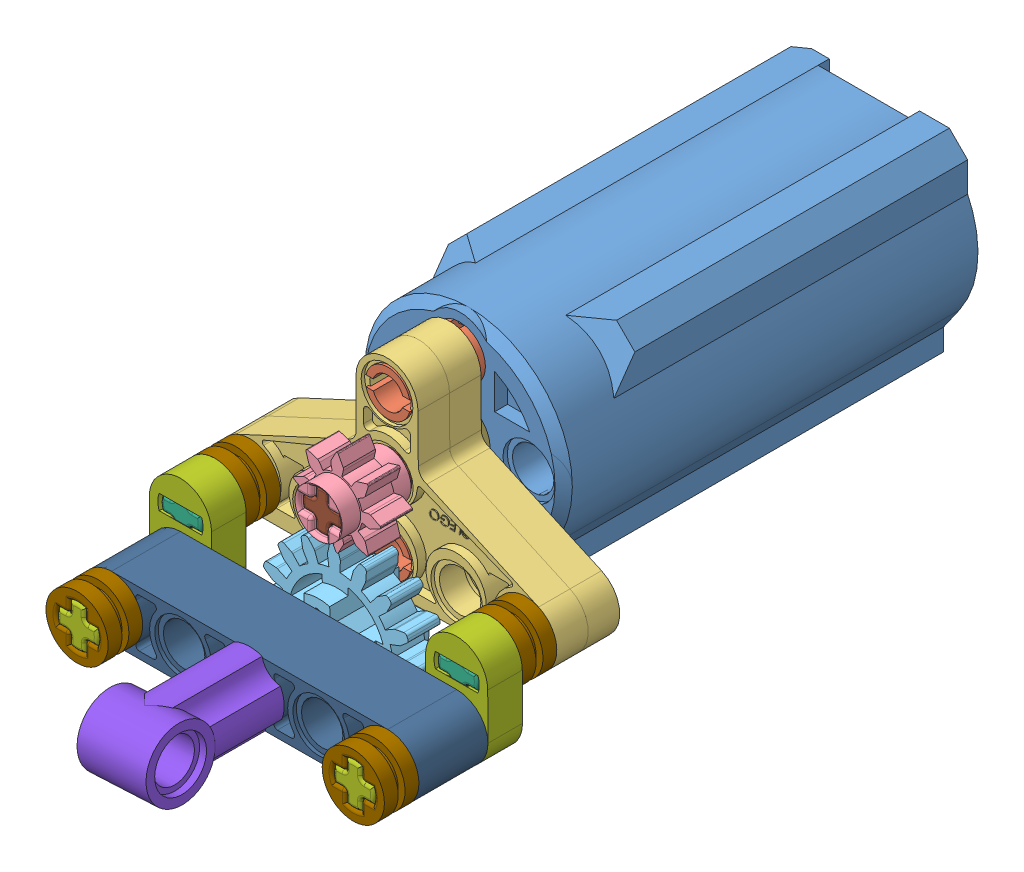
SolidWorks assembly 34.SLDASM, configuration 기본 (file format 9000). Lengths in mm.
Overall size (39.32 34.78 88.4).
20 component instances, 12 part files, 53 mates.
Components (placement in the parent):
- 9V Motor M-1: 9V Motor M.SLDPRT [기본] at (-7.0258 1.7944 48.1336) size (24 24 48.27)
- 2780 Pin with Friction Ridges Lengthwise WITH Center Slots-1: 2780 Pin with Friction Ridges Lengthwise WITH Center Slots.SLDPRT [기본] at (-7.0258 -6.2056 72.4336) x (1 0 0) z (0 1 0) size (6 16 5.88)
- 2905 Liftarm Triangle Thin-1: 2905 Liftarm Triangle Thin.SLDPRT [기본] at (-7.0101 -9.8056 75.0586) x (0.99999 0.004375 0) z (0.004375 -0.99999 0) size (39.2 3.65 23.2)
- 2905 Liftarm Triangle Thin-2: 2905 Liftarm Triangle Thin.SLDPRT [기본] at (-7.0101 -9.8055 78.7086) x (0.99999 0.004375 0) z (0.004375 -0.99999 0) size (39.2 3.65 23.2)
- 3647 Gear 8-1: 3647 Gear 8.SLDPRT [기본] at (-7.0258 1.7944 84.5336) x (1 0 0) z (0 1 0) size (10.06 8 10.06)
- 94925 Gear 16 old-1: 94925 Gear 16 old.SLDPRT [기본] at (-7.0025 -11.5384 84.5336) x (0.99871 0.05078 0) z (-0.05078 0.99871 0) size (18 8 18)
- 32062 Axle 2 Notched-1: 32062 Axle 2 Notched.SLDPRT [기본] at (-23.0257 -6.2755 72.4836) x (0.99999 0.004375 0) z (0.004375 -0.99999 0) size (4.8 16.01 4.8)
- 2853 Engine Crankshaft-1: 2853 Engine Crankshaft.SLDPRT [기본] at (-35.5332 -12.1174 85.2384) x (0.004375 -0.99999 0) z (0.99999 0.004375 0) size (12.53 16 7.2)
- 32013 Axle pin connector angled #1-1: 32013 Axle pin connector angled #1.SLDPRT [기본] at (-7.0025 -11.5384 96.5336) x (0 0 -1) z (0.99871 0.05078 0) size (16 8 8)
- 32123 Bush 0.5 Smooth-1: 32123 Bush 0.5 Smooth.SLDPRT [기본] at (10.5595 1.0715 83.3402) x (0.99999 0.004375 0) z (0.004375 -0.99999 0) size (7.2 4 7.2)
- 32316 Beam 5-1: 32316 Beam 5.SLDPRT [기본] at (-23.0023 -11.6084 88.5336) x (0.99999 0.004375 0) z (0.004375 -0.99999 0) size (39.2 8 7.2)
- 4519 Axle 3-1: 4519 Axle 3.SLDPRT [기본] at (-7.0258 1.7944 88.1336) x (1 0 0) z (0 1 0) size (4.8 24.01 4.8)
- Motor 9V  PF Medium part-1: Motor 9V  PF Medium part.SLDPRT [기본] at (-5.0345 1.2532 64.1336) size (7 7 8)
- 2780 Pin with Friction Ridges Lengthwise WITH Center Slots-2: 2780 Pin with Friction Ridges Lengthwise WITH Center Slots.SLDPRT [기본] at (-7.0958 9.7944 72.4336) x (1 0 0) z (0 1 0) size (6 16 5.88)
- 32062 Axle 2 Notched-2: 32062 Axle 2 Notched.SLDPRT [기본] at (8.974 -6.1355 72.4836) x (0.99999 0.004375 0) z (0.004375 -0.99999 0) size (4.8 16.01 4.8)
- 2853 Engine Crankshaft-2: 2853 Engine Crankshaft.SLDPRT [기본] at (-3.5335 -11.9774 85.2384) x (0.004375 -0.99999 0) z (0.99999 0.004375 0) size (12.53 16 7.2)
- 32123 Bush 0.5 Smooth-2: 32123 Bush 0.5 Smooth.SLDPRT [기본] at (-21.4402 0.9315 83.3402) x (0.99999 0.004375 0) z (0.004375 -0.99999 0) size (7.2 4 7.2)
- 4519 Axle 3-2: 4519 Axle 3.SLDPRT [기본] at (-7.0025 -11.5384 104.5336) x (0.99871 0.05078 0) z (-0.05078 0.99871 0) size (4.8 24.01 4.8)
- 32123 Bush 0.5 Smooth-3: 32123 Bush 0.5 Smooth.SLDPRT [기본] at (7.3489 -4.2756 97.7269) x (-0.99999 -0.004375 0) z (0.004375 -0.99999 0) size (7.2 4 7.2)
- 32123 Bush 0.5 Smooth-4: 32123 Bush 0.5 Smooth.SLDPRT [기본] at (-21.4168 -4.4014 99.3402) x (0.99999 0.004375 0) z (0.004375 -0.99999 0) size (7.2 4 7.2)
Mates (geometry in assembly coordinates):
- 동심1: concentric: cylinder of 9V Motor M-1 through (-7.0258 1.7944 72.1336) axis (0 0 1) radius 3.505; cylinder of Motor 9V  PF Medium part-1 through (-7.0258 1.7944 72.1336) axis (0 0 -1) radius 3.5
- 일치1: coincident: plane of 9V Motor M-1 through (-7.0258 1.7944 72.1336) normal (0 0 1); plane of Motor 9V  PF Medium part-1 through (-7.0258 1.7944 72.1336) normal (0 0 1)
- 동심3: concentric: cylinder of 9V Motor M-1 through (-7.0258 -6.2056 72.1336) axis (0 0 1) radius 2.4; cylinder of 2780 Pin with Friction Ridges Lengthwise WITH Center Slots-1 through (-7.0258 -6.2056 80.4336) axis (0 0 -1) radius 2.4
- 일치3: coincident: plane of 9V Motor M-1 through (-4.6258 -6.2056 71.6336) normal (0 0 1); plane of 2780 Pin with Friction Ridges Lengthwise WITH Center Slots-1 through (-7.0258 -6.2056 71.6336) normal (0 0 -1)
- 동심4: concentric: cylinder of 9V Motor M-1 through (-7.0958 9.7944 72.1336) axis (0 0 1) radius 2.4; cylinder of 2780 Pin with Friction Ridges Lengthwise WITH Center Slots-2 through (-7.0958 9.7944 80.4336) axis (0 0 -1) radius 2.4
- 일치4: coincident: plane of 9V Motor M-1 through (-4.6958 9.7944 71.6336) normal (0 0 1); plane of 2780 Pin with Friction Ridges Lengthwise WITH Center Slots-2 through (-7.0958 9.7944 71.6336) normal (0 0 -1)
- 동심5: concentric: cylinder of 4519 Axle 3-1 through (-7.0258 1.7944 64.1336) axis (0 0 1) radius 2.4; cylinder of Motor 9V  PF Medium part-1 through (-7.0258 1.7944 72.1336) axis (0 0 -1) radius 2.4
- 일치5: coincident: plane of 4519 Axle 3-1 through (-6.1458 0.9144 64.1336) normal (0 -1 0); plane of Motor 9V  PF Medium part-1 through (-5.7458 0.9144 72.1336) normal (0 1 0)
- 일치6: coincident: plane of 4519 Axle 3-1 through (-7.0258 1.7944 64.1336) normal (0 0 -1); circle of Motor 9V  PF Medium part-1
- 동심7: concentric: cylinder of 2780 Pin with Friction Ridges Lengthwise WITH Center Slots-1 through (-7.0258 -6.2056 80.4336) axis (0 0 -1) radius 2.4; cylinder of 2905 Liftarm Triangle Thin-1 through (-7.0258 -6.2056 73.2336) axis (0 0 1) radius 2.4
- 동심8: concentric: cylinder of 2905 Liftarm Triangle Thin-1 through (-7.0958 9.7942 73.2336) axis (0 0 1) radius 2.4; cylinder of 2780 Pin with Friction Ridges Lengthwise WITH Center Slots-2 through (-7.0958 9.7944 80.4336) axis (0 0 -1) radius 2.4
- 일치7: coincident: plane of 2905 Liftarm Triangle Thin-1 through (-22.9029 -5.7538 73.2336) normal (0 0 -1); plane of 2780 Pin with Friction Ridges Lengthwise WITH Center Slots-2 through (-7.0958 9.7944 73.2336) normal (0 0 1)
- 동심9: concentric: cylinder of 2780 Pin with Friction Ridges Lengthwise WITH Center Slots-1 through (-7.0258 -6.2056 80.4336) axis (0 0 -1) radius 2.4; cylinder of 2905 Liftarm Triangle Thin-2 through (-7.0258 -6.2056 76.8836) axis (0 0 1) radius 2.4
- 동심10: concentric: cylinder of 2905 Liftarm Triangle Thin-2 through (-7.0958 9.7942 76.8836) axis (0 0 1) radius 2.4; cylinder of 2780 Pin with Friction Ridges Lengthwise WITH Center Slots-2 through (-7.0958 9.7944 80.4336) axis (0 0 -1) radius 2.4
- 일치8: coincident: plane of 2905 Liftarm Triangle Thin-1 through (-22.9029 -5.7538 76.8836) normal (0 0 1); plane of 2905 Liftarm Triangle Thin-2 through (-22.9029 -5.7538 76.8836) normal (0 0 -1)
- 동심11: concentric: cylinder of 2905 Liftarm Triangle Thin-2 through (8.974 -6.1356 76.8836) axis (0 0 1) radius 2.4; cylinder of 32062 Axle 2 Notched-2 through (8.974 -6.1356 88.4836) axis (0 0 -1) radius 2.4
- 일치9: coincident: plane of 2905 Liftarm Triangle Thin-2 through (11.203 -5.2459 76.8836) normal (0.004375 -0.99999 0); plane of 32062 Axle 2 Notched-2 through (9.8502 -5.2518 88.4836) normal (-0.004375 0.99999 0)
- 동심12: concentric: cylinder of 32062 Axle 2 Notched-2 through (8.974 -6.1356 88.4836) axis (0 0 -1) radius 2.4; cylinder of 2853 Engine Crankshaft-2 through (8.974 -6.1356 84.5336) axis (0 0 1) radius 2.6182
- 일치10: coincident: plane of 32062 Axle 2 Notched-2 through (9.8502 -5.2518 88.4836) normal (-0.004375 0.99999 0); plane of 2853 Engine Crankshaft-2 through (8.0902 -5.2595 84.5336) normal (0.004375 -0.99999 0)
- 일치11: coincident: plane of 32062 Axle 2 Notched-2 through (8.974 -6.1356 88.4836) normal (0 0 1); plane of 2853 Engine Crankshaft-2 through (9.009 -14.1356 88.4836) normal (0 0 -1)
- 동심13: concentric: cylinder of 32123 Bush 0.5 Smooth-1 through (8.974 -6.1356 76.5336) axis (0 0 1) radius 2.4; cylinder of 32062 Axle 2 Notched-2 through (8.974 -6.1356 88.4836) axis (0 0 -1) radius 2.4
- 일치12: coincident: plane of 32123 Bush 0.5 Smooth-1 through (6.7451 -7.0254 88.5336) normal (-0.004375 0.99999 0); plane of 32062 Axle 2 Notched-2 through (8.0979 -7.0195 88.4836) normal (0.004375 -0.99999 0)
- 일치13: coincident: plane of 32123 Bush 0.5 Smooth-1 through (8.974 -6.1356 84.5336) normal (0 0 1); plane of 2853 Engine Crankshaft-2 through (8.974 -6.1356 84.5336) normal (0 0 -1)
- 일치14: coincident: plane of 2905 Liftarm Triangle Thin-2 through (-22.9029 -5.7538 80.5336) normal (0 0 1); plane of 32123 Bush 0.5 Smooth-1 through (8.974 -6.1356 80.5336) normal (0 0 -1)
- 동심14: concentric: cylinder of 2905 Liftarm Triangle Thin-2 through (-23.0257 -6.2756 76.8836) axis (0 0 1) radius 2.4; cylinder of 32062 Axle 2 Notched-1 through (-23.0257 -6.2756 88.4836) axis (0 0 -1) radius 2.4
- 일치15: coincident: plane of 2905 Liftarm Triangle Thin-2 through (-25.2623 -5.4054 76.8836) normal (0.004375 -0.99999 0); plane of 32062 Axle 2 Notched-1 through (-25.2623 -5.4054 88.4836) normal (-0.004375 0.99999 0)
- 동심15: concentric: cylinder of 32062 Axle 2 Notched-1 through (-23.0257 -6.2756 88.4836) axis (0 0 -1) radius 2.4; cylinder of 2853 Engine Crankshaft-1 through (-23.0257 -6.2756 84.5336) axis (0 0 1) radius 2.6182
- 일치16: coincident: plane of 32062 Axle 2 Notched-1 through (-25.2623 -5.4054 88.4836) normal (-0.004375 0.99999 0); plane of 2853 Engine Crankshaft-1 through (-23.9095 -5.3995 84.5336) normal (0.004375 -0.99999 0)
- 일치17: coincident: plane of 32062 Axle 2 Notched-1 through (-23.0257 -6.2756 88.4836) normal (0 0 1); plane of 2853 Engine Crankshaft-1 through (-22.9907 -14.2756 88.4836) normal (0 0 -1)
- 동심16: concentric: cylinder of 32062 Axle 2 Notched-1 through (-23.0257 -6.2756 88.4836) axis (0 0 -1) radius 2.4; cylinder of 32123 Bush 0.5 Smooth-2 through (-23.0257 -6.2756 76.5336) axis (0 0 1) radius 2.4
- 일치18: coincident: plane of 32062 Axle 2 Notched-1 through (-23.9018 -7.1595 88.4836) normal (0.004375 -0.99999 0); plane of 32123 Bush 0.5 Smooth-2 through (-25.2546 -7.1654 88.5336) normal (-0.004375 0.99999 0)
- 일치19: coincident: plane of 2853 Engine Crankshaft-1 through (-23.0257 -6.2756 84.5336) normal (0 0 -1); plane of 32123 Bush 0.5 Smooth-2 through (-23.0257 -6.2756 84.5336) normal (0 0 1)
- 일치20: coincident: plane of 2905 Liftarm Triangle Thin-2 through (-22.9029 -5.7538 80.5336) normal (0 0 1); plane of 32123 Bush 0.5 Smooth-2 through (-23.0257 -6.2756 80.5336) normal (0 0 -1)
- 동심17: concentric: cylinder of 3647 Gear 8-1 through (-7.0258 1.7944 88.5336) axis (0 0 -1) radius 2.4; cylinder of 4519 Axle 3-1 through (-7.0258 1.7944 64.1336) axis (0 0 1) radius 2.4
- 일치22: coincident: plane of 3647 Gear 8-1 through (-4.793 0.9144 88.5336) normal (0 1 0); plane of 4519 Axle 3-1 through (-6.1458 0.9144 64.1336) normal (0 -1 0)
- 일치23: coincident: plane of 2905 Liftarm Triangle Thin-2 through (-22.9029 -5.7538 80.5336) normal (0 0 1); plane of 3647 Gear 8-1 through (-7.0258 1.7944 80.5336) normal (0 0 -1)
- 동심18: concentric: cylinder of 32316 Beam 5-1 through (8.9974 -11.4686 96.5336) axis (0 0 -1) radius 2.4; cylinder of 2853 Engine Crankshaft-2 through (8.9974 -11.4686 84.5336) axis (0 0 1) radius 2.4
- 동심19: concentric: cylinder of 2853 Engine Crankshaft-1 through (-23.0023 -11.6086 84.5336) axis (0 0 1) radius 2.4; cylinder of 32316 Beam 5-1 through (-23.0023 -11.6086 96.5336) axis (0 0 -1) radius 2.4
- 일치24: coincident: plane of 32316 Beam 5-1 through (-23.0023 -11.6086 88.5336) normal (0 0 -1); plane of 2853 Engine Crankshaft-2 through (8.974 -6.1356 88.5336) normal (0 0 1)
- 동심20: concentric: cylinder of 94925 Gear 16 old-1 through (-7.0025 -11.5386 88.5336) axis (0 0 -1) radius 2.4; cylinder of 4519 Axle 3-2 through (-7.0025 -11.5386 80.5336) axis (0 0 1) radius 2.4
- 일치25: coincident: plane of 94925 Gear 16 old-1 through (-6.0586 -12.7723 88.5336) normal (-0.99871 -0.05078 0); plane of 4519 Axle 3-2 through (-6.0789 -12.3728 80.5336) normal (0.99871 0.05078 0)
- 동심21: concentric: cylinder of 32316 Beam 5-1 through (-7.0025 -11.5386 96.5336) axis (0 0 -1) radius 2.4; cylinder of 4519 Axle 3-2 through (-7.0025 -11.5386 80.5336) axis (0 0 1) radius 2.4
- 일치26: coincident: plane of 3647 Gear 8-1 through (-12.2596 7.0282 82.6786) normal (0 0 -1); plane of 94925 Gear 16 old-1 through (-16.8257 -2.666 82.6786) normal (0 0 -1)
- 일치27: coincident: plane of 94925 Gear 16 old-1 through (-7.0025 -11.5386 80.5336) normal (0 0 -1); plane of 4519 Axle 3-2 through (-7.0025 -11.5386 80.5336) normal (0 0 -1)
- 동심22: concentric: cylinder of 32013 Axle pin connector angled #1-1 through (-7.0025 -11.5386 112.5346) axis (0 0 -1) radius 2.4; cylinder of 4519 Axle 3-2 through (-7.0025 -11.5386 80.5336) axis (0 0 1) radius 2.4
- 일치28: coincident: plane of 32013 Axle pin connector angled #1-1 through (-6.0789 -12.3728 112.5346) normal (-0.05078 0.99871 0); plane of 4519 Axle 3-2 through (-6.0789 -12.3728 80.5336) normal (0.05078 -0.99871 0)
- 탄젠트1: tangent: cylinder of 32013 Axle pin connector angled #1-1 through (-10.9973 -11.7417 108.5336) axis (0.99871 0.05078 0) radius 4; plane of 4519 Axle 3-2 through (-7.0025 -11.5386 104.5336) normal (0 0 1)
- 동심23: concentric: cylinder of 32123 Bush 0.5 Smooth-3 through (8.9974 -11.4686 92.5336) axis (0 0 1) radius 2.4; cylinder of 2853 Engine Crankshaft-2 through (8.9974 -11.4686 84.5336) axis (0 0 1) radius 2.4
- 일치29: coincident: plane of 2853 Engine Crankshaft-2 through (9.8812 -12.3447 100.5336) normal (0.004375 -0.99999 0); plane of 32123 Bush 0.5 Smooth-3 through (11.234 -12.3388 92.5336) normal (-0.004375 0.99999 0)
- 일치30: coincident: plane of 32316 Beam 5-1 through (-23.0023 -11.6086 96.5336) normal (0 0 1); plane of 32123 Bush 0.5 Smooth-3 through (8.9974 -11.4686 96.5336) normal (0 0 -1)
- 동심24: concentric: cylinder of 2853 Engine Crankshaft-1 through (-23.0023 -11.6086 84.5336) axis (0 0 1) radius 2.4; cylinder of 32123 Bush 0.5 Smooth-4 through (-23.0023 -11.6086 104.5336) axis (0 0 -1) radius 2.4
- 일치31: coincident: plane of 2853 Engine Crankshaft-1 through (-23.8862 -10.7324 100.5336) normal (-0.004375 0.99999 0); plane of 32123 Bush 0.5 Smooth-4 through (-25.239 -10.7384 92.5336) normal (0.004375 -0.99999 0)
- 일치32: coincident: plane of 32316 Beam 5-1 through (-23.0023 -11.6086 96.5336) normal (0 0 1); plane of 32123 Bush 0.5 Smooth-4 through (-23.0023 -11.6086 96.5336) normal (0 0 -1)
